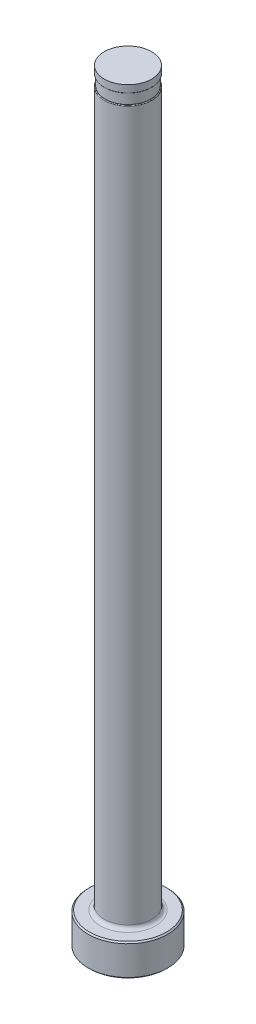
ISO-10303-21;
HEADER;
FILE_DESCRIPTION(('STEP AP214'),'2;1');
FILE_NAME('part.step','',(''),(''),'','','');
FILE_SCHEMA(('AUTOMOTIVE_DESIGN { 1 0 10303 214 1 1 1 1 }'));
ENDSEC;
DATA;
#1=APPLICATION_CONTEXT('core data for automotive mechanical design processes');
#2=APPLICATION_PROTOCOL_DEFINITION('international standard','automotive_design',2000,#1);
#3=PRODUCT_CONTEXT('',#1,'mechanical');
#4=PRODUCT('Part','Part','',(#3));
#5=PRODUCT_RELATED_PRODUCT_CATEGORY('part','',(#4));
#6=PRODUCT_DEFINITION_FORMATION('','',#4);
#7=PRODUCT_DEFINITION_CONTEXT('part definition',#1,'design');
#8=PRODUCT_DEFINITION('design','',#6,#7);
#9=PRODUCT_DEFINITION_SHAPE('','',#8);
#10=(LENGTH_UNIT() NAMED_UNIT(*) SI_UNIT(.MILLI.,.METRE.));
#11=(NAMED_UNIT(*) PLANE_ANGLE_UNIT() SI_UNIT($,.RADIAN.));
#12=(NAMED_UNIT(*) SI_UNIT($,.STERADIAN.) SOLID_ANGLE_UNIT());
#13=UNCERTAINTY_MEASURE_WITH_UNIT(LENGTH_MEASURE(1.E-05),#10,'distance_accuracy_value','');
#14=(GEOMETRIC_REPRESENTATION_CONTEXT(3) GLOBAL_UNCERTAINTY_ASSIGNED_CONTEXT((#13)) GLOBAL_UNIT_ASSIGNED_CONTEXT((#10,
#11,#12)) REPRESENTATION_CONTEXT('',''));
#15=CARTESIAN_POINT('',(0.,0.,0.));
#16=DIRECTION('',(0.,0.,1.));
#17=DIRECTION('',(1.,0.,0.));
#18=AXIS2_PLACEMENT_3D('',#15,#16,#17);
#19=CARTESIAN_POINT('',(-4.76249999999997,150.876,0.));
#20=DIRECTION('',(0.,1.,0.));
#21=DIRECTION('',(0.,0.,1.));
#22=AXIS2_PLACEMENT_3D('',#19,#20,#21);
#23=PLANE('',#22);
#24=CARTESIAN_POINT('',(0.,150.876,0.));
#25=DIRECTION('',(0.,1.,0.));
#26=DIRECTION('',(0.,0.,1.));
#27=AXIS2_PLACEMENT_3D('',#24,#25,#26);
#28=CIRCLE('',#27,4.61009999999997);
#29=CARTESIAN_POINT('',(0.,150.876,4.61009999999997));
#30=VERTEX_POINT('',#29);
#31=EDGE_CURVE('E11',#30,#30,#28,.F.);
#32=ORIENTED_EDGE('',*,*,#31,.T.);
#33=EDGE_LOOP('',(#32));
#34=FACE_BOUND('',#33,.T.);
#35=CARTESIAN_POINT('',(0.,150.876,0.));
#36=DIRECTION('',(0.,1.,0.));
#37=DIRECTION('',(0.,0.,1.));
#38=AXIS2_PLACEMENT_3D('',#35,#36,#37);
#39=CIRCLE('',#38,4.55929999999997);
#40=CARTESIAN_POINT('',(0.,150.876,4.55929999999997));
#41=VERTEX_POINT('',#40);
#42=EDGE_CURVE('E78',#41,#41,#39,.T.);
#43=ORIENTED_EDGE('',*,*,#42,.T.);
#44=EDGE_LOOP('',(#43));
#45=FACE_BOUND('',#44,.T.);
#46=ADVANCED_FACE('F36',(#34,#45),#23,.F.);
#47=CARTESIAN_POINT('',(0.,259.958771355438,0.));
#48=DIRECTION('',(0.,1.,0.));
#49=DIRECTION('',(0.,0.,1.));
#50=AXIS2_PLACEMENT_3D('',#47,#48,#49);
#51=CYLINDRICAL_SURFACE('',#50,4.76249999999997);
#52=DIRECTION('',(0.,1.,0.));
#53=VECTOR('',#52,1.);
#54=CARTESIAN_POINT('',(-4.55929999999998,259.958771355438,-1.37629566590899));
#55=LINE('',#54,#53);
#56=CARTESIAN_POINT('',(-4.55929999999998,148.717,-1.37629566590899));
#57=VERTEX_POINT('',#56);
#58=CARTESIAN_POINT('',(-4.55929999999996,86.36,-1.37629566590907));
#59=VERTEX_POINT('',#58);
#60=EDGE_CURVE('E73',#57,#59,#55,.F.);
#61=ORIENTED_EDGE('',*,*,#60,.F.);
#62=CARTESIAN_POINT('',(0.,148.717,0.));
#63=DIRECTION('',(0.,-1.,0.));
#64=DIRECTION('',(0.,0.,-1.));
#65=AXIS2_PLACEMENT_3D('',#62,#63,#64);
#66=CIRCLE('',#65,4.76249999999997);
#67=CARTESIAN_POINT('',(-4.55929999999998,148.717,1.37629566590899));
#68=VERTEX_POINT('',#67);
#69=EDGE_CURVE('E51',#57,#68,#66,.T.);
#70=ORIENTED_EDGE('',*,*,#69,.T.);
#71=DIRECTION('',(0.,1.,0.));
#72=VECTOR('',#71,1.);
#73=CARTESIAN_POINT('',(-4.55929999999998,259.958771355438,1.37629566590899));
#74=LINE('',#73,#72);
#75=CARTESIAN_POINT('',(-4.55929999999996,86.36,1.37629566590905));
#76=VERTEX_POINT('',#75);
#77=EDGE_CURVE('E84',#76,#68,#74,.T.);
#78=ORIENTED_EDGE('',*,*,#77,.F.);
#79=CARTESIAN_POINT('',(-4.55929999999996,86.36,-1.37629566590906));
#80=CARTESIAN_POINT('',(-4.55929737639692,86.3312402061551,-1.37629775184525));
#81=CARTESIAN_POINT('',(-4.55969127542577,86.3024975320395,-1.37500007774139));
#82=CARTESIAN_POINT('',(-4.56124470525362,86.2452773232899,-1.36984087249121));
#83=CARTESIAN_POINT('',(-4.5624038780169,86.2167996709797,-1.36598054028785));
#84=CARTESIAN_POINT('',(-4.56696801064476,86.1324539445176,-1.35067685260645));
#85=CARTESIAN_POINT('',(-4.5714603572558,86.0772762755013,-1.33550964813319));
#86=CARTESIAN_POINT('',(-4.58280020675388,85.9706988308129,-1.29605614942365));
#87=CARTESIAN_POINT('',(-4.58964466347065,85.9192942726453,-1.27178164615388));
#88=CARTESIAN_POINT('',(-4.60493832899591,85.8213127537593,-1.2152383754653));
#89=CARTESIAN_POINT('',(-4.61338924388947,85.7747410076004,-1.18296109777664));
#90=CARTESIAN_POINT('',(-4.63119432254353,85.6866407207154,-1.11122717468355));
#91=CARTESIAN_POINT('',(-4.64055936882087,85.6451909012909,-1.07167734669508));
#92=CARTESIAN_POINT('',(-4.65929799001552,85.5684511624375,-0.987030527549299));
#93=CARTESIAN_POINT('',(-4.66867156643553,85.5331627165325,-0.941932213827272));
#94=CARTESIAN_POINT('',(-4.68829944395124,85.4633161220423,-0.839298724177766));
#95=CARTESIAN_POINT('',(-4.69843056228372,85.4299130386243,-0.780955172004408));
#96=CARTESIAN_POINT('',(-4.71694909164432,85.3714876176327,-0.659965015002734));
#97=CARTESIAN_POINT('',(-4.72533534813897,85.3464708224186,-0.597315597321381));
#98=CARTESIAN_POINT('',(-4.74110178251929,85.3007147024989,-0.457354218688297));
#99=CARTESIAN_POINT('',(-4.74801655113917,85.2815974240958,-0.379457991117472));
#100=CARTESIAN_POINT('',(-4.75800499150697,85.2543334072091,-0.221524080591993));
#101=CARTESIAN_POINT('',(-4.76107621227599,85.246193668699,-0.141485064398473));
#102=CARTESIAN_POINT('',(-4.76327668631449,85.2403271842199,0.0299431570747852));
#103=CARTESIAN_POINT('',(-4.76181415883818,85.2441641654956,0.121398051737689));
#104=CARTESIAN_POINT('',(-4.75374911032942,85.2658915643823,0.302489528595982));
#105=CARTESIAN_POINT('',(-4.74714208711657,85.2837942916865,0.392124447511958));
#106=CARTESIAN_POINT('',(-4.72930079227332,85.3346459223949,0.568426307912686));
#107=CARTESIAN_POINT('',(-4.71798291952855,85.3678679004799,0.655007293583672));
#108=CARTESIAN_POINT('',(-4.69215822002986,85.4501393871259,0.819736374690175));
#109=CARTESIAN_POINT('',(-4.67765906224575,85.4991509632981,0.897904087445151));
#110=CARTESIAN_POINT('',(-4.65260917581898,85.5948873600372,1.01840460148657));
#111=CARTESIAN_POINT('',(-4.642278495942,85.6373315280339,1.06420330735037));
#112=CARTESIAN_POINT('',(-4.62221244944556,85.7293278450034,1.14822353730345));
#113=CARTESIAN_POINT('',(-4.61247679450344,85.7788765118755,1.18644875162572));
#114=CARTESIAN_POINT('',(-4.59462030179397,85.8846759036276,1.2538357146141));
#115=CARTESIAN_POINT('',(-4.58651300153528,85.9409770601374,1.28292253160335));
#116=CARTESIAN_POINT('',(-4.57311393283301,86.058357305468,1.3299034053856));
#117=CARTESIAN_POINT('',(-4.56781667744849,86.119426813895,1.34781928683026));
#118=CARTESIAN_POINT('',(-4.56265822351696,86.2110432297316,1.36513201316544));
#119=CARTESIAN_POINT('',(-4.5614036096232,86.2406738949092,1.36931216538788));
#120=CARTESIAN_POINT('',(-4.55972347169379,86.3001961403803,1.37489368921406));
#121=CARTESIAN_POINT('',(-4.55929732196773,86.3300875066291,1.37629715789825));
#122=CARTESIAN_POINT('',(-4.55929999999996,86.36,1.37629566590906));
#123=B_SPLINE_CURVE_WITH_KNOTS('',3,(#79,#80,#81,#82,#83,#84,#85,#86,#87,#88,#89,#90,#91,#92,
#93,#94,#95,#96,#97,#98,#99,#100,#101,#102,#103,#104,#105,#106,#107,#108,#109,#110,#111,#112,
#113,#114,#115,#116,#117,#118,#119,#120,#121,#122),.UNSPECIFIED.,.F.,.F.,(4,2,2,2,2,2,2,2,2,2,2,
2,2,2,2,2,2,2,2,2,2,4),(0.,0.086214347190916,0.172388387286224,0.343564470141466,
0.514519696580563,0.685657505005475,0.859163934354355,1.03271180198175,1.23591349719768,
1.43924922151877,1.67981780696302,1.92053972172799,2.1939427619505,2.4675853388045,
2.74630643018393,3.02436286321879,3.21350217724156,3.40254910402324,3.59310796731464,
3.78329335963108,3.87302183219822,3.9626825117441),.UNSPECIFIED.);
#124=EDGE_CURVE('E81',#59,#76,#123,.T.);
#125=ORIENTED_EDGE('',*,*,#124,.F.);
#126=EDGE_LOOP('',(#61,#70,#78,#125));
#127=FACE_BOUND('',#126,.T.);
#128=CARTESIAN_POINT('',(0.,7.11200000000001,0.));
#129=DIRECTION('',(0.,1.,0.));
#130=DIRECTION('',(0.,0.,1.));
#131=AXIS2_PLACEMENT_3D('',#128,#129,#130);
#132=CIRCLE('',#131,4.76249999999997);
#133=CARTESIAN_POINT('',(0.,7.11200000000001,4.76249999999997));
#134=VERTEX_POINT('',#133);
#135=EDGE_CURVE('E116',#134,#134,#132,.T.);
#136=ORIENTED_EDGE('',*,*,#135,.T.);
#137=EDGE_LOOP('',(#136));
#138=FACE_BOUND('',#137,.T.);
#139=ADVANCED_FACE('F82',(#127,#138),#51,.T.);
#140=CARTESIAN_POINT('',(0.,0.,0.));
#141=DIRECTION('',(0.,-1.,0.));
#142=DIRECTION('',(0.,0.,-1.));
#143=AXIS2_PLACEMENT_3D('',#140,#141,#142);
#144=PLANE('',#143);
#145=CARTESIAN_POINT('',(0.,0.,0.));
#146=DIRECTION('',(0.,-1.,0.));
#147=DIRECTION('',(0.,0.,-1.));
#148=AXIS2_PLACEMENT_3D('',#145,#146,#147);
#149=CIRCLE('',#148,7.68349999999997);
#150=CARTESIAN_POINT('',(0.,0.,-7.68349999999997));
#151=VERTEX_POINT('',#150);
#152=EDGE_CURVE('E113',#151,#151,#149,.T.);
#153=ORIENTED_EDGE('',*,*,#152,.T.);
#154=EDGE_LOOP('',(#153));
#155=FACE_BOUND('',#154,.T.);
#156=ADVANCED_FACE('F192',(#155),#144,.T.);
#157=CARTESIAN_POINT('',(0.,259.958771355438,0.));
#158=DIRECTION('',(0.,1.,0.));
#159=DIRECTION('',(0.,0.,1.));
#160=AXIS2_PLACEMENT_3D('',#157,#158,#159);
#161=CYLINDRICAL_SURFACE('',#160,7.93749999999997);
#162=CARTESIAN_POINT('',(0.,6.09600000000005,0.));
#163=DIRECTION('',(0.,1.,0.));
#164=DIRECTION('',(0.,0.,1.));
#165=AXIS2_PLACEMENT_3D('',#162,#163,#164);
#166=CIRCLE('',#165,7.93749999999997);
#167=CARTESIAN_POINT('',(0.,6.09600000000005,7.93749999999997));
#168=VERTEX_POINT('',#167);
#169=EDGE_CURVE('E110',#168,#168,#166,.F.);
#170=ORIENTED_EDGE('',*,*,#169,.T.);
#171=EDGE_LOOP('',(#170));
#172=FACE_BOUND('',#171,.T.);
#173=CARTESIAN_POINT('',(0.,0.253999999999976,0.));
#174=DIRECTION('',(0.,-1.,0.));
#175=DIRECTION('',(0.,0.,-1.));
#176=AXIS2_PLACEMENT_3D('',#173,#174,#175);
#177=CIRCLE('',#176,7.93749999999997);
#178=CARTESIAN_POINT('',(0.,0.253999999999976,-7.93749999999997));
#179=VERTEX_POINT('',#178);
#180=EDGE_CURVE('E107',#179,#179,#177,.F.);
#181=ORIENTED_EDGE('',*,*,#180,.T.);
#182=EDGE_LOOP('',(#181));
#183=FACE_BOUND('',#182,.T.);
#184=ADVANCED_FACE('F195',(#172,#183),#161,.T.);
#185=CARTESIAN_POINT('',(-7.93749999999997,6.35,0.));
#186=DIRECTION('',(0.,1.,0.));
#187=DIRECTION('',(0.,0.,1.));
#188=AXIS2_PLACEMENT_3D('',#185,#186,#187);
#189=PLANE('',#188);
#190=CARTESIAN_POINT('',(0.,6.35,0.));
#191=DIRECTION('',(0.,1.,0.));
#192=DIRECTION('',(0.,0.,1.));
#193=AXIS2_PLACEMENT_3D('',#190,#191,#192);
#194=CIRCLE('',#193,5.52449999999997);
#195=CARTESIAN_POINT('',(0.,6.35,5.52449999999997));
#196=VERTEX_POINT('',#195);
#197=EDGE_CURVE('E87',#196,#196,#194,.F.);
#198=ORIENTED_EDGE('',*,*,#197,.T.);
#199=EDGE_LOOP('',(#198));
#200=FACE_BOUND('',#199,.T.);
#201=CARTESIAN_POINT('',(0.,6.35,0.));
#202=DIRECTION('',(0.,1.,0.));
#203=DIRECTION('',(0.,0.,1.));
#204=AXIS2_PLACEMENT_3D('',#201,#202,#203);
#205=CIRCLE('',#204,7.68350000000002);
#206=CARTESIAN_POINT('',(0.,6.35,7.68350000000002));
#207=VERTEX_POINT('',#206);
#208=EDGE_CURVE('E104',#207,#207,#205,.T.);
#209=ORIENTED_EDGE('',*,*,#208,.T.);
#210=EDGE_LOOP('',(#209));
#211=FACE_BOUND('',#210,.T.);
#212=ADVANCED_FACE('F190',(#200,#211),#189,.T.);
#213=CARTESIAN_POINT('',(0.,6.35000000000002,0.));
#214=DIRECTION('',(0.,-1.,0.));
#215=DIRECTION('',(0.,0.,-1.));
#216=AXIS2_PLACEMENT_3D('',#213,#214,#215);
#217=CONICAL_SURFACE('',#216,7.6835,0.785398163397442);
#218=ORIENTED_EDGE('',*,*,#169,.F.);
#219=EDGE_LOOP('',(#218));
#220=FACE_BOUND('',#219,.T.);
#221=ORIENTED_EDGE('',*,*,#208,.F.);
#222=EDGE_LOOP('',(#221));
#223=FACE_BOUND('',#222,.T.);
#224=ADVANCED_FACE('F186',(#220,#223),#217,.T.);
#225=CARTESIAN_POINT('',(0.,0.253999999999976,0.));
#226=DIRECTION('',(0.,1.,0.));
#227=DIRECTION('',(0.,0.,1.));
#228=AXIS2_PLACEMENT_3D('',#225,#226,#227);
#229=CONICAL_SURFACE('',#228,7.93749999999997,0.785398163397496);
#230=ORIENTED_EDGE('',*,*,#152,.F.);
#231=EDGE_LOOP('',(#230));
#232=FACE_BOUND('',#231,.T.);
#233=ORIENTED_EDGE('',*,*,#180,.F.);
#234=EDGE_LOOP('',(#233));
#235=FACE_BOUND('',#234,.T.);
#236=ADVANCED_FACE('F182',(#232,#235),#229,.T.);
#237=CARTESIAN_POINT('',(0.,7.11200000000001,0.));
#238=DIRECTION('',(0.,1.,0.));
#239=DIRECTION('',(0.,0.,1.));
#240=AXIS2_PLACEMENT_3D('',#237,#238,#239);
#241=TOROIDAL_SURFACE('',#240,5.52449999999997,0.762);
#242=ORIENTED_EDGE('',*,*,#197,.F.);
#243=EDGE_LOOP('',(#242));
#244=FACE_BOUND('',#243,.T.);
#245=ORIENTED_EDGE('',*,*,#135,.F.);
#246=EDGE_LOOP('',(#245));
#247=FACE_BOUND('',#246,.T.);
#248=ADVANCED_FACE('F147',(#244,#247),#241,.F.);
#249=CARTESIAN_POINT('',(-4.76249999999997,148.844,0.));
#250=DIRECTION('',(0.,-1.,0.));
#251=DIRECTION('',(0.,0.,-1.));
#252=AXIS2_PLACEMENT_3D('',#249,#250,#251);
#253=PLANE('',#252);
#254=DIRECTION('',(0.,0.,1.));
#255=VECTOR('',#254,1.);
#256=CARTESIAN_POINT('',(-4.55929999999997,148.844,0.));
#257=LINE('',#256,#255);
#258=CARTESIAN_POINT('',(-4.55929999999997,148.844,0.));
#259=VERTEX_POINT('',#258);
#260=CARTESIAN_POINT('',(-4.55929999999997,148.844,0.837044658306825));
#261=VERTEX_POINT('',#260);
#262=EDGE_CURVE('E90',#259,#261,#257,.T.);
#263=ORIENTED_EDGE('',*,*,#262,.T.);
#264=CARTESIAN_POINT('',(0.,148.844,0.));
#265=DIRECTION('',(0.,-1.,0.));
#266=DIRECTION('',(0.,0.,-1.));
#267=AXIS2_PLACEMENT_3D('',#264,#265,#266);
#268=CIRCLE('',#267,4.63549999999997);
#269=CARTESIAN_POINT('',(-4.55929999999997,148.844,-0.837044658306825));
#270=VERTEX_POINT('',#269);
#271=EDGE_CURVE('E86',#261,#270,#268,.F.);
#272=ORIENTED_EDGE('',*,*,#271,.T.);
#273=EDGE_CURVE('E79',#270,#259,#257,.T.);
#274=ORIENTED_EDGE('',*,*,#273,.T.);
#275=CARTESIAN_POINT('',(0.,148.844,0.));
#276=DIRECTION('',(0.,1.,0.));
#277=DIRECTION('',(0.,0.,1.));
#278=AXIS2_PLACEMENT_3D('',#275,#276,#277);
#279=CIRCLE('',#278,4.55929999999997);
#280=EDGE_CURVE('E101',#259,#259,#279,.T.);
#281=ORIENTED_EDGE('',*,*,#280,.F.);
#282=EDGE_LOOP('',(#263,#272,#274,#281));
#283=FACE_BOUND('',#282,.T.);
#284=ADVANCED_FACE('F144',(#283),#253,.F.);
#285=CARTESIAN_POINT('',(0.,153.448281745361,0.));
#286=DIRECTION('',(0.,1.,0.));
#287=DIRECTION('',(0.,0.,1.));
#288=AXIS2_PLACEMENT_3D('',#285,#286,#287);
#289=CYLINDRICAL_SURFACE('',#288,4.55929999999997);
#290=ORIENTED_EDGE('',*,*,#42,.F.);
#291=EDGE_LOOP('',(#290));
#292=FACE_BOUND('',#291,.T.);
#293=ORIENTED_EDGE('',*,*,#280,.T.);
#294=EDGE_LOOP('',(#293));
#295=FACE_BOUND('',#294,.T.);
#296=ADVANCED_FACE('F141',(#292,#295),#289,.T.);
#297=CARTESIAN_POINT('',(-4.55929999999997,149.86,-7.93749999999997));
#298=DIRECTION('',(1.,0.,0.));
#299=DIRECTION('',(0.,1.,0.));
#300=AXIS2_PLACEMENT_3D('',#297,#298,#299);
#301=PLANE('',#300);
#302=ORIENTED_EDGE('',*,*,#273,.F.);
#303=CARTESIAN_POINT('',(-4.55929999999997,148.844,-0.837044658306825));
#304=CARTESIAN_POINT('',(-4.55929999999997,148.843996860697,-0.858041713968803));
#305=CARTESIAN_POINT('',(-4.55929999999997,148.843829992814,-0.879040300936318));
#306=CARTESIAN_POINT('',(-4.55929999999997,148.843073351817,-0.921044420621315));
#307=CARTESIAN_POINT('',(-4.55929999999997,148.842483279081,-0.942049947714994));
#308=CARTESIAN_POINT('',(-4.55929999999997,148.840769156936,-0.984421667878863));
#309=CARTESIAN_POINT('',(-4.55929999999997,148.839635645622,-1.00578751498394));
#310=CARTESIAN_POINT('',(-4.55929999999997,148.836687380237,-1.04846310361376));
#311=CARTESIAN_POINT('',(-4.55929999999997,148.834872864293,-1.06977286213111));
#312=CARTESIAN_POINT('',(-4.55929999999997,148.829360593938,-1.12201635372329));
#313=CARTESIAN_POINT('',(-4.55929999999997,148.825181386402,-1.15290757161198));
#314=CARTESIAN_POINT('',(-4.55929999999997,148.816757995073,-1.19875333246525));
#315=CARTESIAN_POINT('',(-4.55929999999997,148.813604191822,-1.21390713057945));
#316=CARTESIAN_POINT('',(-4.55929999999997,148.80632624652,-1.24397628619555));
#317=CARTESIAN_POINT('',(-4.55929999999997,148.802203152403,-1.25889188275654));
#318=CARTESIAN_POINT('',(-4.55929999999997,148.795136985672,-1.28034672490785));
#319=CARTESIAN_POINT('',(-4.55929999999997,148.792754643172,-1.28707008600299));
#320=CARTESIAN_POINT('',(-4.55929999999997,148.787598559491,-1.30038917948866));
#321=CARTESIAN_POINT('',(-4.55929999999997,148.784823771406,-1.30698451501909));
#322=CARTESIAN_POINT('',(-4.55929999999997,148.778425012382,-1.32070015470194));
#323=CARTESIAN_POINT('',(-4.55929999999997,148.774739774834,-1.32779211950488));
#324=CARTESIAN_POINT('',(-4.55929999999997,148.766505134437,-1.34145187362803));
#325=CARTESIAN_POINT('',(-4.55929999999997,148.761959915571,-1.34802199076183));
#326=CARTESIAN_POINT('',(-4.55929999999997,148.754707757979,-1.3564128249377));
#327=CARTESIAN_POINT('',(-4.55929999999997,148.752550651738,-1.35870356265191));
#328=CARTESIAN_POINT('',(-4.55929999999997,148.747986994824,-1.36303580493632));
#329=CARTESIAN_POINT('',(-4.55929999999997,148.745580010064,-1.36507686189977));
#330=CARTESIAN_POINT('',(-4.55929999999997,148.740447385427,-1.36882028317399));
#331=CARTESIAN_POINT('',(-4.55929999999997,148.73771711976,-1.37051646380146));
#332=CARTESIAN_POINT('',(-4.55929999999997,148.731982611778,-1.373337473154));
#333=CARTESIAN_POINT('',(-4.55929999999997,148.728980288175,-1.37446598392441));
#334=CARTESIAN_POINT('',(-4.55929999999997,148.724439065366,-1.37556999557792));
#335=CARTESIAN_POINT('',(-4.55929999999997,148.722969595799,-1.3758395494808));
#336=CARTESIAN_POINT('',(-4.55929999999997,148.720000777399,-1.37620343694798));
#337=CARTESIAN_POINT('',(-4.55929999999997,148.718501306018,-1.3762967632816));
#338=CARTESIAN_POINT('',(-4.55929999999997,148.717,-1.37629566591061));
#339=B_SPLINE_CURVE_WITH_KNOTS('',3,(#303,#304,#305,#306,#307,#308,#309,#310,#311,#312,#313,
#314,#315,#316,#317,#318,#319,#320,#321,#322,#323,#324,#325,#326,#327,#328,#329,#330,#331,#332,
#333,#334,#335,#336,#337,#338),.UNSPECIFIED.,.F.,.F.,(4,2,2,2,2,2,2,2,2,2,2,2,2,2,2,2,2,4),(0.,
0.0629926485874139,0.126029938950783,0.190207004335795,0.254361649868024,0.347770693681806,
0.394187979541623,0.440555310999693,0.461946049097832,0.483394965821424,0.507342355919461,
0.531176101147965,0.540601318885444,0.550043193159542,0.559641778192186,0.569177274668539,
0.573649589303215,0.578147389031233),.UNSPECIFIED.);
#340=EDGE_CURVE('E59',#270,#57,#339,.T.);
#341=ORIENTED_EDGE('',*,*,#340,.T.);
#342=ORIENTED_EDGE('',*,*,#60,.T.);
#343=DIRECTION('',(0.,0.,1.));
#344=VECTOR('',#343,1.);
#345=CARTESIAN_POINT('',(-4.55929999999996,86.36,-7.93749999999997));
#346=LINE('',#345,#344);
#347=EDGE_CURVE('E77',#59,#76,#346,.T.);
#348=ORIENTED_EDGE('',*,*,#347,.T.);
#349=ORIENTED_EDGE('',*,*,#77,.T.);
#350=CARTESIAN_POINT('',(-4.55929999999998,148.717,1.37629566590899));
#351=CARTESIAN_POINT('',(-4.55929999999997,148.719444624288,1.3763038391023));
#352=CARTESIAN_POINT('',(-4.55929999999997,148.721877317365,1.37605183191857));
#353=CARTESIAN_POINT('',(-4.55929999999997,148.726619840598,1.37510642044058));
#354=CARTESIAN_POINT('',(-4.55929999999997,148.728930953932,1.37441958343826));
#355=CARTESIAN_POINT('',(-4.55929999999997,148.733943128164,1.37247105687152));
#356=CARTESIAN_POINT('',(-4.55929999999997,148.736605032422,1.3711110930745));
#357=CARTESIAN_POINT('',(-4.55929999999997,148.741689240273,1.36798215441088));
#358=CARTESIAN_POINT('',(-4.55929999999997,148.744109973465,1.36621072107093));
#359=CARTESIAN_POINT('',(-4.55929999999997,148.750401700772,1.36098866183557));
#360=CARTESIAN_POINT('',(-4.55929999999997,148.7540371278,1.35725807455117));
#361=CARTESIAN_POINT('',(-4.55929999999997,148.760750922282,1.34933701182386));
#362=CARTESIAN_POINT('',(-4.55929999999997,148.763828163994,1.34514563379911));
#363=CARTESIAN_POINT('',(-4.55929999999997,148.775141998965,1.32813171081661));
#364=CARTESIAN_POINT('',(-4.55929999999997,148.781833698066,1.31430846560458));
#365=CARTESIAN_POINT('',(-4.55929999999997,148.793426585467,1.28593719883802));
#366=CARTESIAN_POINT('',(-4.55929999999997,148.798315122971,1.27138484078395));
#367=CARTESIAN_POINT('',(-4.55929999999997,148.806580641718,1.24300288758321));
#368=CARTESIAN_POINT('',(-4.55929999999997,148.810042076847,1.22919836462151));
#369=CARTESIAN_POINT('',(-4.55929999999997,148.816216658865,1.20142059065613));
#370=CARTESIAN_POINT('',(-4.55929999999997,148.818929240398,1.18744722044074));
#371=CARTESIAN_POINT('',(-4.55929999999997,148.826216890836,1.14532367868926));
#372=CARTESIAN_POINT('',(-4.55929999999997,148.82992779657,1.11702450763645));
#373=CARTESIAN_POINT('',(-4.55929999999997,148.835831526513,1.06027711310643));
#374=CARTESIAN_POINT('',(-4.55929999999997,148.838023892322,1.031828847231));
#375=CARTESIAN_POINT('',(-4.55929999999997,148.841305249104,0.974900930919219));
#376=CARTESIAN_POINT('',(-4.55929999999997,148.842395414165,0.946421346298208));
#377=CARTESIAN_POINT('',(-4.55929999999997,148.843399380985,0.904435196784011));
#378=CARTESIAN_POINT('',(-4.55929999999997,148.843630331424,0.890934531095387));
#379=CARTESIAN_POINT('',(-4.55929999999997,148.843930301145,0.863970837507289));
#380=CARTESIAN_POINT('',(-4.55929999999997,148.843999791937,0.85050781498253));
#381=CARTESIAN_POINT('',(-4.55929999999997,148.844,0.837044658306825));
#382=B_SPLINE_CURVE_WITH_KNOTS('',3,(#350,#351,#352,#353,#354,#355,#356,#357,#358,#359,#360,
#361,#362,#363,#364,#365,#366,#367,#368,#369,#370,#371,#372,#373,#374,#375,#376,#377,#378,#379,
#380,#381),.UNSPECIFIED.,.F.,.F.,(4,2,2,2,2,2,2,2,2,2,2,2,2,2,2,4),(0.,0.00730179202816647,
0.0144958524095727,0.0234127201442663,0.0323843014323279,0.0479233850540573,0.0634934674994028,
0.109206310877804,0.155234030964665,0.197892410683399,0.240582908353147,0.326131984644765,
0.411706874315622,0.497190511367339,0.537697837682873,0.578086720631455),.UNSPECIFIED.);
#383=EDGE_CURVE('E172',#68,#261,#382,.T.);
#384=ORIENTED_EDGE('',*,*,#383,.T.);
#385=ORIENTED_EDGE('',*,*,#262,.F.);
#386=EDGE_LOOP('',(#302,#341,#342,#348,#349,#384,#385));
#387=FACE_BOUND('',#386,.T.);
#388=ADVANCED_FACE('F75',(#387),#301,.F.);
#389=CARTESIAN_POINT('',(-7.73429999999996,86.36,-7.93749999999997));
#390=DIRECTION('',(0.,0.,1.));
#391=DIRECTION('',(1.,0.,0.));
#392=AXIS2_PLACEMENT_3D('',#389,#390,#391);
#393=CYLINDRICAL_SURFACE('',#392,3.175);
#394=ORIENTED_EDGE('',*,*,#347,.F.);
#395=ORIENTED_EDGE('',*,*,#124,.T.);
#396=EDGE_LOOP('',(#394,#395));
#397=FACE_BOUND('',#396,.T.);
#398=ADVANCED_FACE('F89',(#397),#393,.F.);
#399=CARTESIAN_POINT('',(0.,152.687735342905,0.));
#400=DIRECTION('',(0.,1.,0.));
#401=DIRECTION('',(0.,0.,1.));
#402=AXIS2_PLACEMENT_3D('',#399,#400,#401);
#403=CYLINDRICAL_SURFACE('',#402,4.73709999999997);
#404=CARTESIAN_POINT('',(0.,151.003,0.));
#405=DIRECTION('',(0.,1.,0.));
#406=DIRECTION('',(0.,0.,1.));
#407=AXIS2_PLACEMENT_3D('',#404,#405,#406);
#408=CIRCLE('',#407,4.73709999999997);
#409=CARTESIAN_POINT('',(0.,151.003,4.73709999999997));
#410=VERTEX_POINT('',#409);
#411=EDGE_CURVE('E44',#410,#410,#408,.T.);
#412=ORIENTED_EDGE('',*,*,#411,.T.);
#413=EDGE_LOOP('',(#412));
#414=FACE_BOUND('',#413,.T.);
#415=CARTESIAN_POINT('',(0.,152.4,0.));
#416=DIRECTION('',(0.,1.,0.));
#417=DIRECTION('',(0.,0.,1.));
#418=AXIS2_PLACEMENT_3D('',#415,#416,#417);
#419=CIRCLE('',#418,4.73709999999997);
#420=CARTESIAN_POINT('',(0.,152.4,4.73709999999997));
#421=VERTEX_POINT('',#420);
#422=EDGE_CURVE('E91',#421,#421,#419,.T.);
#423=ORIENTED_EDGE('',*,*,#422,.F.);
#424=EDGE_LOOP('',(#423));
#425=FACE_BOUND('',#424,.T.);
#426=ADVANCED_FACE('F135',(#414,#425),#403,.T.);
#427=CARTESIAN_POINT('',(-4.76249999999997,152.4,0.));
#428=DIRECTION('',(0.,1.,0.));
#429=DIRECTION('',(0.,0.,1.));
#430=AXIS2_PLACEMENT_3D('',#427,#428,#429);
#431=PLANE('',#430);
#432=ORIENTED_EDGE('',*,*,#422,.T.);
#433=EDGE_LOOP('',(#432));
#434=FACE_BOUND('',#433,.T.);
#435=ADVANCED_FACE('F149',(#434),#431,.T.);
#436=CARTESIAN_POINT('',(0.,148.717,0.));
#437=DIRECTION('',(0.,-1.,0.));
#438=DIRECTION('',(0.,0.,-1.));
#439=AXIS2_PLACEMENT_3D('',#436,#437,#438);
#440=TOROIDAL_SURFACE('',#439,4.63549999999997,0.127);
#441=ORIENTED_EDGE('',*,*,#383,.F.);
#442=ORIENTED_EDGE('',*,*,#69,.F.);
#443=ORIENTED_EDGE('',*,*,#340,.F.);
#444=ORIENTED_EDGE('',*,*,#271,.F.);
#445=EDGE_LOOP('',(#441,#442,#443,#444));
#446=FACE_BOUND('',#445,.T.);
#447=ADVANCED_FACE('F151',(#446),#440,.T.);
#448=CARTESIAN_POINT('',(0.,151.003,0.));
#449=DIRECTION('',(0.,1.,0.));
#450=DIRECTION('',(0.,0.,1.));
#451=AXIS2_PLACEMENT_3D('',#448,#449,#450);
#452=TOROIDAL_SURFACE('',#451,4.61009999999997,0.127);
#453=ORIENTED_EDGE('',*,*,#31,.F.);
#454=EDGE_LOOP('',(#453));
#455=FACE_BOUND('',#454,.T.);
#456=ORIENTED_EDGE('',*,*,#411,.F.);
#457=EDGE_LOOP('',(#456));
#458=FACE_BOUND('',#457,.T.);
#459=ADVANCED_FACE('F38',(#455,#458),#452,.T.);
#460=CLOSED_SHELL('',(#46,#139,#156,#184,#212,#224,#236,#248,#284,#296,#388,#398,#426,#435,#447,#459));
#461=MANIFOLD_SOLID_BREP('B2',#460);
#462=ADVANCED_BREP_SHAPE_REPRESENTATION('',(#18,#461),#14);
#463=SHAPE_DEFINITION_REPRESENTATION(#9,#462);
ENDSEC;
END-ISO-10303-21;
